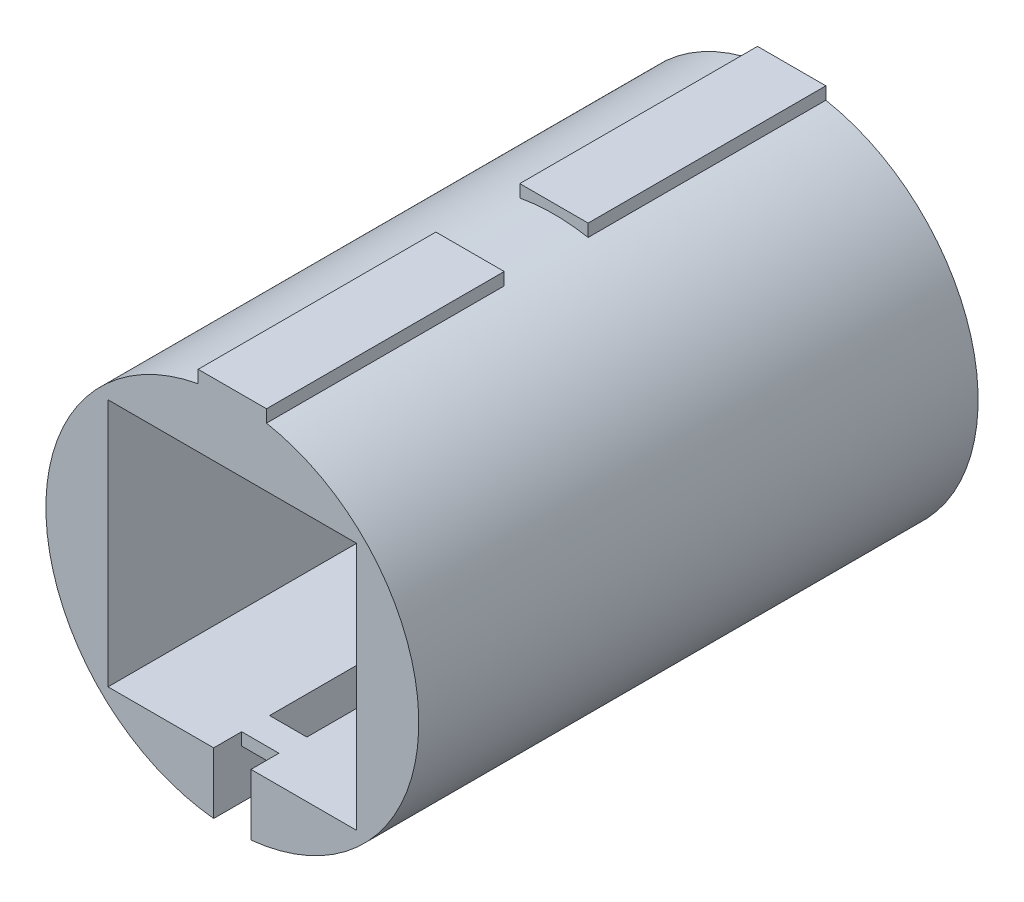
ISO-10303-21;
HEADER;
FILE_DESCRIPTION(('STEP AP214'),'2;1');
FILE_NAME('part.step','',(''),(''),'','','');
FILE_SCHEMA(('AUTOMOTIVE_DESIGN { 1 0 10303 214 1 1 1 1 }'));
ENDSEC;
DATA;
#1=APPLICATION_CONTEXT('core data for automotive mechanical design processes');
#2=APPLICATION_PROTOCOL_DEFINITION('international standard','automotive_design',2000,#1);
#3=PRODUCT_CONTEXT('',#1,'mechanical');
#4=PRODUCT('Part','Part','',(#3));
#5=PRODUCT_RELATED_PRODUCT_CATEGORY('part','',(#4));
#6=PRODUCT_DEFINITION_FORMATION('','',#4);
#7=PRODUCT_DEFINITION_CONTEXT('part definition',#1,'design');
#8=PRODUCT_DEFINITION('design','',#6,#7);
#9=PRODUCT_DEFINITION_SHAPE('','',#8);
#10=(LENGTH_UNIT() NAMED_UNIT(*) SI_UNIT(.MILLI.,.METRE.));
#11=(NAMED_UNIT(*) PLANE_ANGLE_UNIT() SI_UNIT($,.RADIAN.));
#12=(NAMED_UNIT(*) SI_UNIT($,.STERADIAN.) SOLID_ANGLE_UNIT());
#13=UNCERTAINTY_MEASURE_WITH_UNIT(LENGTH_MEASURE(1.E-05),#10,'distance_accuracy_value','');
#14=(GEOMETRIC_REPRESENTATION_CONTEXT(3) GLOBAL_UNCERTAINTY_ASSIGNED_CONTEXT((#13)) GLOBAL_UNIT_ASSIGNED_CONTEXT((#10,
#11,#12)) REPRESENTATION_CONTEXT('',''));
#15=CARTESIAN_POINT('',(0.,0.,0.));
#16=DIRECTION('',(0.,0.,1.));
#17=DIRECTION('',(1.,0.,0.));
#18=AXIS2_PLACEMENT_3D('',#15,#16,#17);
#19=CARTESIAN_POINT('',(0.,0.,22.5));
#20=DIRECTION('',(0.,0.,-1.));
#21=DIRECTION('',(-1.,0.,0.));
#22=AXIS2_PLACEMENT_3D('',#19,#20,#21);
#23=CYLINDRICAL_SURFACE('',#22,15.);
#24=DIRECTION('',(0.,0.,-1.));
#25=VECTOR('',#24,1.);
#26=CARTESIAN_POINT('',(2.75,14.7457621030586,22.5));
#27=LINE('',#26,#25);
#28=CARTESIAN_POINT('',(2.75,14.7457621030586,-22.5));
#29=VERTEX_POINT('',#28);
#30=CARTESIAN_POINT('',(2.75,14.7457621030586,-3.375));
#31=VERTEX_POINT('',#30);
#32=EDGE_CURVE('E204',#29,#31,#27,.F.);
#33=ORIENTED_EDGE('',*,*,#32,.T.);
#34=CARTESIAN_POINT('',(0.,-6.15826833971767E-13,-3.375));
#35=DIRECTION('',(0.,0.,1.));
#36=DIRECTION('',(1.,0.,0.));
#37=AXIS2_PLACEMENT_3D('',#34,#35,#36);
#38=CIRCLE('',#37,15.0000000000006);
#39=CARTESIAN_POINT('',(-2.75,14.7457621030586,-3.375));
#40=VERTEX_POINT('',#39);
#41=EDGE_CURVE('E29',#31,#40,#38,.T.);
#42=ORIENTED_EDGE('',*,*,#41,.T.);
#43=DIRECTION('',(0.,0.,-1.));
#44=VECTOR('',#43,1.);
#45=CARTESIAN_POINT('',(-2.75,14.7457621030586,22.5));
#46=LINE('',#45,#44);
#47=CARTESIAN_POINT('',(-2.75,14.7457621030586,-22.5));
#48=VERTEX_POINT('',#47);
#49=EDGE_CURVE('E200',#48,#40,#46,.F.);
#50=ORIENTED_EDGE('',*,*,#49,.F.);
#51=CARTESIAN_POINT('',(0.,0.,-22.5));
#52=DIRECTION('',(0.,0.,1.));
#53=DIRECTION('',(1.,0.,0.));
#54=AXIS2_PLACEMENT_3D('',#51,#52,#53);
#55=CIRCLE('',#54,15.);
#56=CARTESIAN_POINT('',(-1.5,-14.9248115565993,-22.5));
#57=VERTEX_POINT('',#56);
#58=EDGE_CURVE('E287',#48,#57,#55,.T.);
#59=ORIENTED_EDGE('',*,*,#58,.T.);
#60=DIRECTION('',(0.,0.,-1.));
#61=VECTOR('',#60,1.);
#62=CARTESIAN_POINT('',(-1.5,-14.9248115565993,22.5));
#63=LINE('',#62,#61);
#64=CARTESIAN_POINT('',(-1.5,-14.9248115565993,22.5));
#65=VERTEX_POINT('',#64);
#66=EDGE_CURVE('E9',#65,#57,#63,.T.);
#67=ORIENTED_EDGE('',*,*,#66,.F.);
#68=CARTESIAN_POINT('',(0.,0.,22.5));
#69=DIRECTION('',(0.,0.,1.));
#70=DIRECTION('',(1.,0.,0.));
#71=AXIS2_PLACEMENT_3D('',#68,#69,#70);
#72=CIRCLE('',#71,15.);
#73=CARTESIAN_POINT('',(-2.75,14.7457621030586,22.5));
#74=VERTEX_POINT('',#73);
#75=EDGE_CURVE('E288',#74,#65,#72,.T.);
#76=ORIENTED_EDGE('',*,*,#75,.F.);
#77=DIRECTION('',(0.,0.,-1.));
#78=VECTOR('',#77,1.);
#79=CARTESIAN_POINT('',(-2.75,14.7457621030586,22.5));
#80=LINE('',#79,#78);
#81=CARTESIAN_POINT('',(-2.75,14.7457621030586,3.375));
#82=VERTEX_POINT('',#81);
#83=EDGE_CURVE('E217',#82,#74,#80,.F.);
#84=ORIENTED_EDGE('',*,*,#83,.F.);
#85=CARTESIAN_POINT('',(0.,-6.15826833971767E-13,3.375));
#86=DIRECTION('',(0.,0.,1.));
#87=DIRECTION('',(1.,0.,0.));
#88=AXIS2_PLACEMENT_3D('',#85,#86,#87);
#89=CIRCLE('',#88,15.0000000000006);
#90=CARTESIAN_POINT('',(2.75,14.7457621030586,3.375));
#91=VERTEX_POINT('',#90);
#92=EDGE_CURVE('E230',#91,#82,#89,.T.);
#93=ORIENTED_EDGE('',*,*,#92,.F.);
#94=DIRECTION('',(0.,0.,-1.));
#95=VECTOR('',#94,1.);
#96=CARTESIAN_POINT('',(2.75,14.7457621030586,22.5));
#97=LINE('',#96,#95);
#98=CARTESIAN_POINT('',(2.75,14.7457621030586,22.5));
#99=VERTEX_POINT('',#98);
#100=EDGE_CURVE('E181',#91,#99,#97,.F.);
#101=ORIENTED_EDGE('',*,*,#100,.T.);
#102=CARTESIAN_POINT('',(0.,0.,22.5));
#103=DIRECTION('',(0.,0.,1.));
#104=DIRECTION('',(1.,0.,0.));
#105=AXIS2_PLACEMENT_3D('',#102,#103,#104);
#106=CIRCLE('',#105,15.);
#107=CARTESIAN_POINT('',(1.5,-14.9248115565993,22.5));
#108=VERTEX_POINT('',#107);
#109=EDGE_CURVE('E305',#108,#99,#106,.T.);
#110=ORIENTED_EDGE('',*,*,#109,.F.);
#111=DIRECTION('',(0.,0.,-1.));
#112=VECTOR('',#111,1.);
#113=CARTESIAN_POINT('',(1.5,-14.9248115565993,22.5));
#114=LINE('',#113,#112);
#115=CARTESIAN_POINT('',(1.5,-14.9248115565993,-22.5));
#116=VERTEX_POINT('',#115);
#117=EDGE_CURVE('E310',#108,#116,#114,.T.);
#118=ORIENTED_EDGE('',*,*,#117,.T.);
#119=CARTESIAN_POINT('',(0.,0.,-22.5));
#120=DIRECTION('',(0.,0.,1.));
#121=DIRECTION('',(1.,0.,0.));
#122=AXIS2_PLACEMENT_3D('',#119,#120,#121);
#123=CIRCLE('',#122,15.);
#124=EDGE_CURVE('E328',#116,#29,#123,.T.);
#125=ORIENTED_EDGE('',*,*,#124,.T.);
#126=EDGE_LOOP('',(#33,#42,#50,#59,#67,#76,#84,#93,#101,#110,#118,#125));
#127=FACE_BOUND('',#126,.T.);
#128=ADVANCED_FACE('F14',(#127),#23,.T.);
#129=CARTESIAN_POINT('',(1.5,15.75,22.5));
#130=DIRECTION('',(0.,-1.,0.));
#131=DIRECTION('',(0.,0.,-1.));
#132=AXIS2_PLACEMENT_3D('',#129,#130,#131);
#133=PLANE('',#132);
#134=DIRECTION('',(-1.,0.,0.));
#135=VECTOR('',#134,1.);
#136=CARTESIAN_POINT('',(1.5,15.75,-3.375));
#137=LINE('',#136,#135);
#138=CARTESIAN_POINT('',(2.75,15.75,-3.375));
#139=VERTEX_POINT('',#138);
#140=CARTESIAN_POINT('',(-2.75,15.75,-3.375));
#141=VERTEX_POINT('',#140);
#142=EDGE_CURVE('E174',#139,#141,#137,.T.);
#143=ORIENTED_EDGE('',*,*,#142,.F.);
#144=DIRECTION('',(0.,0.,1.));
#145=VECTOR('',#144,1.);
#146=CARTESIAN_POINT('',(2.75,15.75,-3.375));
#147=LINE('',#146,#145);
#148=CARTESIAN_POINT('',(2.75,15.75,-22.5));
#149=VERTEX_POINT('',#148);
#150=EDGE_CURVE('E177',#149,#139,#147,.T.);
#151=ORIENTED_EDGE('',*,*,#150,.F.);
#152=DIRECTION('',(-1.,0.,0.));
#153=VECTOR('',#152,1.);
#154=CARTESIAN_POINT('',(1.5,15.75,-22.5));
#155=LINE('',#154,#153);
#156=CARTESIAN_POINT('',(-2.75,15.75,-22.5));
#157=VERTEX_POINT('',#156);
#158=EDGE_CURVE('E291',#149,#157,#155,.T.);
#159=ORIENTED_EDGE('',*,*,#158,.T.);
#160=DIRECTION('',(0.,0.,1.));
#161=VECTOR('',#160,1.);
#162=CARTESIAN_POINT('',(-2.75,15.75,-3.375));
#163=LINE('',#162,#161);
#164=EDGE_CURVE('E179',#157,#141,#163,.T.);
#165=ORIENTED_EDGE('',*,*,#164,.T.);
#166=EDGE_LOOP('',(#143,#151,#159,#165));
#167=FACE_BOUND('',#166,.T.);
#168=ADVANCED_FACE('F175',(#167),#133,.F.);
#169=CARTESIAN_POINT('',(-1.5,-14.9248115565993,22.5));
#170=DIRECTION('',(-1.,0.,0.));
#171=DIRECTION('',(0.,0.,1.));
#172=AXIS2_PLACEMENT_3D('',#169,#170,#171);
#173=PLANE('',#172);
#174=DIRECTION('',(0.,0.,-1.));
#175=VECTOR('',#174,1.);
#176=CARTESIAN_POINT('',(-1.5,-11.,-15.75));
#177=LINE('',#176,#175);
#178=CARTESIAN_POINT('',(-1.5,-11.,-15.75));
#179=VERTEX_POINT('',#178);
#180=CARTESIAN_POINT('',(-1.5,-11.,-18.));
#181=VERTEX_POINT('',#180);
#182=EDGE_CURVE('E257',#179,#181,#177,.T.);
#183=ORIENTED_EDGE('',*,*,#182,.F.);
#184=DIRECTION('',(0.,-1.,0.));
#185=VECTOR('',#184,1.);
#186=CARTESIAN_POINT('',(-1.5,-10.,-15.75));
#187=LINE('',#186,#185);
#188=CARTESIAN_POINT('',(-1.5,-10.,-15.75));
#189=VERTEX_POINT('',#188);
#190=EDGE_CURVE('E234',#189,#179,#187,.T.);
#191=ORIENTED_EDGE('',*,*,#190,.F.);
#192=DIRECTION('',(0.,0.,-1.));
#193=VECTOR('',#192,1.);
#194=CARTESIAN_POINT('',(-1.5,-10.,22.5));
#195=LINE('',#194,#193);
#196=CARTESIAN_POINT('',(-1.5,-10.,18.));
#197=VERTEX_POINT('',#196);
#198=EDGE_CURVE('E350',#197,#189,#195,.T.);
#199=ORIENTED_EDGE('',*,*,#198,.F.);
#200=DIRECTION('',(0.,-1.,0.));
#201=VECTOR('',#200,1.);
#202=CARTESIAN_POINT('',(-1.5,-10.,18.));
#203=LINE('',#202,#201);
#204=CARTESIAN_POINT('',(-1.5,-11.,18.));
#205=VERTEX_POINT('',#204);
#206=EDGE_CURVE('E260',#197,#205,#203,.T.);
#207=ORIENTED_EDGE('',*,*,#206,.T.);
#208=DIRECTION('',(0.,0.,-1.));
#209=VECTOR('',#208,1.);
#210=CARTESIAN_POINT('',(-1.5,-11.,20.25));
#211=LINE('',#210,#209);
#212=CARTESIAN_POINT('',(-1.5,-11.,20.25));
#213=VERTEX_POINT('',#212);
#214=EDGE_CURVE('E284',#213,#205,#211,.T.);
#215=ORIENTED_EDGE('',*,*,#214,.F.);
#216=DIRECTION('',(0.,-1.,0.));
#217=VECTOR('',#216,1.);
#218=CARTESIAN_POINT('',(-1.5,-10.,20.25));
#219=LINE('',#218,#217);
#220=CARTESIAN_POINT('',(-1.5,-10.,20.25));
#221=VERTEX_POINT('',#220);
#222=EDGE_CURVE('E261',#221,#213,#219,.T.);
#223=ORIENTED_EDGE('',*,*,#222,.F.);
#224=CARTESIAN_POINT('',(-1.5,-10.,22.5));
#225=VERTEX_POINT('',#224);
#226=EDGE_CURVE('E22',#225,#221,#195,.T.);
#227=ORIENTED_EDGE('',*,*,#226,.F.);
#228=DIRECTION('',(0.,1.,0.));
#229=VECTOR('',#228,1.);
#230=CARTESIAN_POINT('',(-1.5,-14.9248115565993,22.5));
#231=LINE('',#230,#229);
#232=EDGE_CURVE('E290',#65,#225,#231,.T.);
#233=ORIENTED_EDGE('',*,*,#232,.F.);
#234=ORIENTED_EDGE('',*,*,#66,.T.);
#235=DIRECTION('',(0.,1.,0.));
#236=VECTOR('',#235,1.);
#237=CARTESIAN_POINT('',(-1.5,-14.9248115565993,-22.5));
#238=LINE('',#237,#236);
#239=CARTESIAN_POINT('',(-1.5,-10.,-22.5));
#240=VERTEX_POINT('',#239);
#241=EDGE_CURVE('E312',#57,#240,#238,.T.);
#242=ORIENTED_EDGE('',*,*,#241,.T.);
#243=CARTESIAN_POINT('',(-1.5,-10.,-18.));
#244=VERTEX_POINT('',#243);
#245=EDGE_CURVE('E348',#244,#240,#195,.T.);
#246=ORIENTED_EDGE('',*,*,#245,.F.);
#247=DIRECTION('',(0.,-1.,0.));
#248=VECTOR('',#247,1.);
#249=CARTESIAN_POINT('',(-1.5,-10.,-18.));
#250=LINE('',#249,#248);
#251=EDGE_CURVE('E231',#244,#181,#250,.T.);
#252=ORIENTED_EDGE('',*,*,#251,.T.);
#253=EDGE_LOOP('',(#183,#191,#199,#207,#215,#223,#227,#233,#234,#242,#246,#252));
#254=FACE_BOUND('',#253,.T.);
#255=ADVANCED_FACE('F16',(#254),#173,.F.);
#256=CARTESIAN_POINT('',(-10.,-10.,22.5));
#257=DIRECTION('',(-1.,0.,0.));
#258=DIRECTION('',(0.,0.,1.));
#259=AXIS2_PLACEMENT_3D('',#256,#257,#258);
#260=PLANE('',#259);
#261=DIRECTION('',(0.,1.,0.));
#262=VECTOR('',#261,1.);
#263=CARTESIAN_POINT('',(-10.,-10.,-22.5));
#264=LINE('',#263,#262);
#265=CARTESIAN_POINT('',(-10.,-10.,-22.5));
#266=VERTEX_POINT('',#265);
#267=CARTESIAN_POINT('',(-10.,10.,-22.5));
#268=VERTEX_POINT('',#267);
#269=EDGE_CURVE('E317',#266,#268,#264,.T.);
#270=ORIENTED_EDGE('',*,*,#269,.T.);
#271=DIRECTION('',(0.,0.,-1.));
#272=VECTOR('',#271,1.);
#273=CARTESIAN_POINT('',(-10.,10.,22.5));
#274=LINE('',#273,#272);
#275=CARTESIAN_POINT('',(-10.,10.,22.5));
#276=VERTEX_POINT('',#275);
#277=EDGE_CURVE('E343',#276,#268,#274,.T.);
#278=ORIENTED_EDGE('',*,*,#277,.F.);
#279=DIRECTION('',(0.,1.,0.));
#280=VECTOR('',#279,1.);
#281=CARTESIAN_POINT('',(-10.,-10.,22.5));
#282=LINE('',#281,#280);
#283=CARTESIAN_POINT('',(-10.,-10.,22.5));
#284=VERTEX_POINT('',#283);
#285=EDGE_CURVE('E295',#284,#276,#282,.T.);
#286=ORIENTED_EDGE('',*,*,#285,.F.);
#287=DIRECTION('',(0.,0.,-1.));
#288=VECTOR('',#287,1.);
#289=CARTESIAN_POINT('',(-10.,-10.,22.5));
#290=LINE('',#289,#288);
#291=EDGE_CURVE('E346',#284,#266,#290,.T.);
#292=ORIENTED_EDGE('',*,*,#291,.T.);
#293=EDGE_LOOP('',(#270,#278,#286,#292));
#294=FACE_BOUND('',#293,.T.);
#295=ADVANCED_FACE('F376',(#294),#260,.F.);
#296=CARTESIAN_POINT('',(-10.,10.,22.5));
#297=DIRECTION('',(0.,1.,0.));
#298=DIRECTION('',(0.,0.,1.));
#299=AXIS2_PLACEMENT_3D('',#296,#297,#298);
#300=PLANE('',#299);
#301=DIRECTION('',(1.,0.,0.));
#302=VECTOR('',#301,1.);
#303=CARTESIAN_POINT('',(-10.,10.,-22.5));
#304=LINE('',#303,#302);
#305=CARTESIAN_POINT('',(10.,10.,-22.5));
#306=VERTEX_POINT('',#305);
#307=EDGE_CURVE('E319',#268,#306,#304,.T.);
#308=ORIENTED_EDGE('',*,*,#307,.T.);
#309=DIRECTION('',(0.,0.,-1.));
#310=VECTOR('',#309,1.);
#311=CARTESIAN_POINT('',(10.,10.,22.5));
#312=LINE('',#311,#310);
#313=CARTESIAN_POINT('',(10.,10.,22.5));
#314=VERTEX_POINT('',#313);
#315=EDGE_CURVE('E340',#314,#306,#312,.T.);
#316=ORIENTED_EDGE('',*,*,#315,.F.);
#317=DIRECTION('',(1.,0.,0.));
#318=VECTOR('',#317,1.);
#319=CARTESIAN_POINT('',(-10.,10.,22.5));
#320=LINE('',#319,#318);
#321=EDGE_CURVE('E297',#276,#314,#320,.T.);
#322=ORIENTED_EDGE('',*,*,#321,.F.);
#323=ORIENTED_EDGE('',*,*,#277,.T.);
#324=EDGE_LOOP('',(#308,#316,#322,#323));
#325=FACE_BOUND('',#324,.T.);
#326=ADVANCED_FACE('F380',(#325),#300,.F.);
#327=CARTESIAN_POINT('',(10.,10.,22.5));
#328=DIRECTION('',(1.,0.,0.));
#329=DIRECTION('',(0.,0.,-1.));
#330=AXIS2_PLACEMENT_3D('',#327,#328,#329);
#331=PLANE('',#330);
#332=DIRECTION('',(0.,-1.,0.));
#333=VECTOR('',#332,1.);
#334=CARTESIAN_POINT('',(10.,10.,-22.5));
#335=LINE('',#334,#333);
#336=CARTESIAN_POINT('',(10.,-10.,-22.5));
#337=VERTEX_POINT('',#336);
#338=EDGE_CURVE('E321',#306,#337,#335,.T.);
#339=ORIENTED_EDGE('',*,*,#338,.T.);
#340=DIRECTION('',(0.,0.,-1.));
#341=VECTOR('',#340,1.);
#342=CARTESIAN_POINT('',(10.,-10.,22.5));
#343=LINE('',#342,#341);
#344=CARTESIAN_POINT('',(10.,-10.,22.5));
#345=VERTEX_POINT('',#344);
#346=EDGE_CURVE('E336',#345,#337,#343,.T.);
#347=ORIENTED_EDGE('',*,*,#346,.F.);
#348=DIRECTION('',(0.,-1.,0.));
#349=VECTOR('',#348,1.);
#350=CARTESIAN_POINT('',(10.,10.,22.5));
#351=LINE('',#350,#349);
#352=EDGE_CURVE('E299',#314,#345,#351,.T.);
#353=ORIENTED_EDGE('',*,*,#352,.F.);
#354=ORIENTED_EDGE('',*,*,#315,.T.);
#355=EDGE_LOOP('',(#339,#347,#353,#354));
#356=FACE_BOUND('',#355,.T.);
#357=ADVANCED_FACE('F437',(#356),#331,.F.);
#358=CARTESIAN_POINT('',(10.,-10.,22.5));
#359=DIRECTION('',(0.,-1.,0.));
#360=DIRECTION('',(0.,0.,-1.));
#361=AXIS2_PLACEMENT_3D('',#358,#359,#360);
#362=PLANE('',#361);
#363=DIRECTION('',(-1.,0.,0.));
#364=VECTOR('',#363,1.);
#365=CARTESIAN_POINT('',(1.5,-10.,-18.));
#366=LINE('',#365,#364);
#367=CARTESIAN_POINT('',(1.5,-10.,-18.));
#368=VERTEX_POINT('',#367);
#369=EDGE_CURVE('E238',#368,#244,#366,.T.);
#370=ORIENTED_EDGE('',*,*,#369,.T.);
#371=ORIENTED_EDGE('',*,*,#245,.T.);
#372=DIRECTION('',(-1.,0.,0.));
#373=VECTOR('',#372,1.);
#374=CARTESIAN_POINT('',(-1.5,-10.,-22.5));
#375=LINE('',#374,#373);
#376=EDGE_CURVE('E315',#240,#266,#375,.T.);
#377=ORIENTED_EDGE('',*,*,#376,.T.);
#378=ORIENTED_EDGE('',*,*,#291,.F.);
#379=DIRECTION('',(-1.,0.,0.));
#380=VECTOR('',#379,1.);
#381=CARTESIAN_POINT('',(-1.5,-10.,22.5));
#382=LINE('',#381,#380);
#383=EDGE_CURVE('E293',#225,#284,#382,.T.);
#384=ORIENTED_EDGE('',*,*,#383,.F.);
#385=ORIENTED_EDGE('',*,*,#226,.T.);
#386=DIRECTION('',(-1.,0.,0.));
#387=VECTOR('',#386,1.);
#388=CARTESIAN_POINT('',(1.5,-10.,20.25));
#389=LINE('',#388,#387);
#390=CARTESIAN_POINT('',(1.5,-10.,20.25));
#391=VERTEX_POINT('',#390);
#392=EDGE_CURVE('E271',#391,#221,#389,.T.);
#393=ORIENTED_EDGE('',*,*,#392,.F.);
#394=DIRECTION('',(0.,0.,-1.));
#395=VECTOR('',#394,1.);
#396=CARTESIAN_POINT('',(1.5,-10.,22.5));
#397=LINE('',#396,#395);
#398=CARTESIAN_POINT('',(1.5,-10.,22.5));
#399=VERTEX_POINT('',#398);
#400=EDGE_CURVE('E334',#399,#391,#397,.T.);
#401=ORIENTED_EDGE('',*,*,#400,.F.);
#402=DIRECTION('',(-1.,0.,0.));
#403=VECTOR('',#402,1.);
#404=CARTESIAN_POINT('',(10.,-10.,22.5));
#405=LINE('',#404,#403);
#406=EDGE_CURVE('E301',#345,#399,#405,.T.);
#407=ORIENTED_EDGE('',*,*,#406,.F.);
#408=ORIENTED_EDGE('',*,*,#346,.T.);
#409=DIRECTION('',(-1.,0.,0.));
#410=VECTOR('',#409,1.);
#411=CARTESIAN_POINT('',(10.,-10.,-22.5));
#412=LINE('',#411,#410);
#413=CARTESIAN_POINT('',(1.5,-10.,-22.5));
#414=VERTEX_POINT('',#413);
#415=EDGE_CURVE('E323',#337,#414,#412,.T.);
#416=ORIENTED_EDGE('',*,*,#415,.T.);
#417=EDGE_CURVE('E333',#368,#414,#397,.T.);
#418=ORIENTED_EDGE('',*,*,#417,.F.);
#419=EDGE_LOOP('',(#370,#371,#377,#378,#384,#385,#393,#401,#407,#408,#416,#418));
#420=FACE_BOUND('',#419,.T.);
#421=ORIENTED_EDGE('',*,*,#198,.T.);
#422=DIRECTION('',(-1.,0.,0.));
#423=VECTOR('',#422,1.);
#424=CARTESIAN_POINT('',(1.5,-10.,-15.75));
#425=LINE('',#424,#423);
#426=CARTESIAN_POINT('',(1.5,-10.,-15.75));
#427=VERTEX_POINT('',#426);
#428=EDGE_CURVE('E244',#427,#189,#425,.T.);
#429=ORIENTED_EDGE('',*,*,#428,.F.);
#430=CARTESIAN_POINT('',(1.5,-10.,18.));
#431=VERTEX_POINT('',#430);
#432=EDGE_CURVE('E337',#431,#427,#397,.T.);
#433=ORIENTED_EDGE('',*,*,#432,.F.);
#434=DIRECTION('',(-1.,0.,0.));
#435=VECTOR('',#434,1.);
#436=CARTESIAN_POINT('',(1.5,-10.,18.));
#437=LINE('',#436,#435);
#438=EDGE_CURVE('E265',#431,#197,#437,.T.);
#439=ORIENTED_EDGE('',*,*,#438,.T.);
#440=EDGE_LOOP('',(#421,#429,#433,#439));
#441=FACE_BOUND('',#440,.T.);
#442=ADVANCED_FACE('F357',(#420,#441),#362,.F.);
#443=CARTESIAN_POINT('',(1.5,-10.,22.5));
#444=DIRECTION('',(1.,0.,0.));
#445=DIRECTION('',(0.,0.,-1.));
#446=AXIS2_PLACEMENT_3D('',#443,#444,#445);
#447=PLANE('',#446);
#448=ORIENTED_EDGE('',*,*,#432,.T.);
#449=DIRECTION('',(0.,1.,0.));
#450=VECTOR('',#449,1.);
#451=CARTESIAN_POINT('',(1.5,-11.,-15.75));
#452=LINE('',#451,#450);
#453=CARTESIAN_POINT('',(1.5,-11.,-15.75));
#454=VERTEX_POINT('',#453);
#455=EDGE_CURVE('E241',#454,#427,#452,.T.);
#456=ORIENTED_EDGE('',*,*,#455,.F.);
#457=DIRECTION('',(0.,0.,-1.));
#458=VECTOR('',#457,1.);
#459=CARTESIAN_POINT('',(1.5,-11.,-15.75));
#460=LINE('',#459,#458);
#461=CARTESIAN_POINT('',(1.5,-11.,-18.));
#462=VERTEX_POINT('',#461);
#463=EDGE_CURVE('E246',#454,#462,#460,.T.);
#464=ORIENTED_EDGE('',*,*,#463,.T.);
#465=DIRECTION('',(0.,1.,0.));
#466=VECTOR('',#465,1.);
#467=CARTESIAN_POINT('',(1.5,-11.,-18.));
#468=LINE('',#467,#466);
#469=EDGE_CURVE('E252',#462,#368,#468,.T.);
#470=ORIENTED_EDGE('',*,*,#469,.T.);
#471=ORIENTED_EDGE('',*,*,#417,.T.);
#472=DIRECTION('',(0.,-1.,0.));
#473=VECTOR('',#472,1.);
#474=CARTESIAN_POINT('',(1.5,-10.,-22.5));
#475=LINE('',#474,#473);
#476=EDGE_CURVE('E326',#414,#116,#475,.T.);
#477=ORIENTED_EDGE('',*,*,#476,.T.);
#478=ORIENTED_EDGE('',*,*,#117,.F.);
#479=DIRECTION('',(0.,-1.,0.));
#480=VECTOR('',#479,1.);
#481=CARTESIAN_POINT('',(1.5,-10.,22.5));
#482=LINE('',#481,#480);
#483=EDGE_CURVE('E303',#399,#108,#482,.T.);
#484=ORIENTED_EDGE('',*,*,#483,.F.);
#485=ORIENTED_EDGE('',*,*,#400,.T.);
#486=DIRECTION('',(0.,1.,0.));
#487=VECTOR('',#486,1.);
#488=CARTESIAN_POINT('',(1.5,-11.,20.25));
#489=LINE('',#488,#487);
#490=CARTESIAN_POINT('',(1.5,-11.,20.25));
#491=VERTEX_POINT('',#490);
#492=EDGE_CURVE('E268',#491,#391,#489,.T.);
#493=ORIENTED_EDGE('',*,*,#492,.F.);
#494=DIRECTION('',(0.,0.,-1.));
#495=VECTOR('',#494,1.);
#496=CARTESIAN_POINT('',(1.5,-11.,20.25));
#497=LINE('',#496,#495);
#498=CARTESIAN_POINT('',(1.5,-11.,18.));
#499=VERTEX_POINT('',#498);
#500=EDGE_CURVE('E273',#491,#499,#497,.T.);
#501=ORIENTED_EDGE('',*,*,#500,.T.);
#502=DIRECTION('',(0.,1.,0.));
#503=VECTOR('',#502,1.);
#504=CARTESIAN_POINT('',(1.5,-11.,18.));
#505=LINE('',#504,#503);
#506=EDGE_CURVE('E279',#499,#431,#505,.T.);
#507=ORIENTED_EDGE('',*,*,#506,.T.);
#508=EDGE_LOOP('',(#448,#456,#464,#470,#471,#477,#478,#484,#485,#493,#501,#507));
#509=FACE_BOUND('',#508,.T.);
#510=ADVANCED_FACE('F396',(#509),#447,.F.);
#511=DIRECTION('',(-1.,0.,0.));
#512=VECTOR('',#511,1.);
#513=CARTESIAN_POINT('',(1.5,15.75,22.5));
#514=LINE('',#513,#512);
#515=CARTESIAN_POINT('',(2.75,15.75,22.5));
#516=VERTEX_POINT('',#515);
#517=CARTESIAN_POINT('',(-2.75,15.75,22.5));
#518=VERTEX_POINT('',#517);
#519=EDGE_CURVE('E308',#516,#518,#514,.T.);
#520=ORIENTED_EDGE('',*,*,#519,.F.);
#521=DIRECTION('',(0.,0.,1.));
#522=VECTOR('',#521,1.);
#523=CARTESIAN_POINT('',(2.75,15.75,22.5));
#524=LINE('',#523,#522);
#525=CARTESIAN_POINT('',(2.75,15.75,3.375));
#526=VERTEX_POINT('',#525);
#527=EDGE_CURVE('E207',#526,#516,#524,.T.);
#528=ORIENTED_EDGE('',*,*,#527,.F.);
#529=DIRECTION('',(-1.,0.,0.));
#530=VECTOR('',#529,1.);
#531=CARTESIAN_POINT('',(1.5,15.75,3.375));
#532=LINE('',#531,#530);
#533=CARTESIAN_POINT('',(-2.75,15.75,3.375));
#534=VERTEX_POINT('',#533);
#535=EDGE_CURVE('E228',#526,#534,#532,.T.);
#536=ORIENTED_EDGE('',*,*,#535,.T.);
#537=DIRECTION('',(0.,0.,1.));
#538=VECTOR('',#537,1.);
#539=CARTESIAN_POINT('',(-2.75,15.75,22.5));
#540=LINE('',#539,#538);
#541=EDGE_CURVE('E206',#534,#518,#540,.T.);
#542=ORIENTED_EDGE('',*,*,#541,.T.);
#543=EDGE_LOOP('',(#520,#528,#536,#542));
#544=FACE_BOUND('',#543,.T.);
#545=ADVANCED_FACE('F405',(#544),#133,.F.);
#546=CARTESIAN_POINT('',(0.,0.,22.5));
#547=DIRECTION('',(0.,0.,1.));
#548=DIRECTION('',(1.,0.,0.));
#549=AXIS2_PLACEMENT_3D('',#546,#547,#548);
#550=PLANE('',#549);
#551=ORIENTED_EDGE('',*,*,#109,.T.);
#552=DIRECTION('',(0.,-1.,0.));
#553=VECTOR('',#552,1.);
#554=CARTESIAN_POINT('',(2.75,14.25,22.5));
#555=LINE('',#554,#553);
#556=EDGE_CURVE('E210',#516,#99,#555,.T.);
#557=ORIENTED_EDGE('',*,*,#556,.F.);
#558=ORIENTED_EDGE('',*,*,#519,.T.);
#559=DIRECTION('',(0.,-1.,0.));
#560=VECTOR('',#559,1.);
#561=CARTESIAN_POINT('',(-2.75,14.25,22.5));
#562=LINE('',#561,#560);
#563=EDGE_CURVE('E220',#518,#74,#562,.T.);
#564=ORIENTED_EDGE('',*,*,#563,.T.);
#565=ORIENTED_EDGE('',*,*,#75,.T.);
#566=ORIENTED_EDGE('',*,*,#232,.T.);
#567=ORIENTED_EDGE('',*,*,#383,.T.);
#568=ORIENTED_EDGE('',*,*,#285,.T.);
#569=ORIENTED_EDGE('',*,*,#321,.T.);
#570=ORIENTED_EDGE('',*,*,#352,.T.);
#571=ORIENTED_EDGE('',*,*,#406,.T.);
#572=ORIENTED_EDGE('',*,*,#483,.T.);
#573=EDGE_LOOP('',(#551,#557,#558,#564,#565,#566,#567,#568,#569,#570,#571,#572));
#574=FACE_BOUND('',#573,.T.);
#575=ADVANCED_FACE('F384',(#574),#550,.T.);
#576=CARTESIAN_POINT('',(0.,0.,-22.5));
#577=DIRECTION('',(0.,0.,1.));
#578=DIRECTION('',(1.,0.,0.));
#579=AXIS2_PLACEMENT_3D('',#576,#577,#578);
#580=PLANE('',#579);
#581=ORIENTED_EDGE('',*,*,#58,.F.);
#582=DIRECTION('',(0.,1.,0.));
#583=VECTOR('',#582,1.);
#584=CARTESIAN_POINT('',(-2.75,14.25,-22.5));
#585=LINE('',#584,#583);
#586=EDGE_CURVE('E193',#48,#157,#585,.T.);
#587=ORIENTED_EDGE('',*,*,#586,.T.);
#588=ORIENTED_EDGE('',*,*,#158,.F.);
#589=DIRECTION('',(0.,1.,0.));
#590=VECTOR('',#589,1.);
#591=CARTESIAN_POINT('',(2.75,14.25,-22.5));
#592=LINE('',#591,#590);
#593=EDGE_CURVE('E188',#29,#149,#592,.T.);
#594=ORIENTED_EDGE('',*,*,#593,.F.);
#595=ORIENTED_EDGE('',*,*,#124,.F.);
#596=ORIENTED_EDGE('',*,*,#476,.F.);
#597=ORIENTED_EDGE('',*,*,#415,.F.);
#598=ORIENTED_EDGE('',*,*,#338,.F.);
#599=ORIENTED_EDGE('',*,*,#307,.F.);
#600=ORIENTED_EDGE('',*,*,#269,.F.);
#601=ORIENTED_EDGE('',*,*,#376,.F.);
#602=ORIENTED_EDGE('',*,*,#241,.F.);
#603=EDGE_LOOP('',(#581,#587,#588,#594,#595,#596,#597,#598,#599,#600,#601,#602));
#604=FACE_BOUND('',#603,.T.);
#605=ADVANCED_FACE('F371',(#604),#580,.F.);
#606=CARTESIAN_POINT('',(-1.5,-11.,20.25));
#607=DIRECTION('',(0.,1.,0.));
#608=DIRECTION('',(0.,0.,1.));
#609=AXIS2_PLACEMENT_3D('',#606,#607,#608);
#610=PLANE('',#609);
#611=DIRECTION('',(1.,0.,0.));
#612=VECTOR('',#611,1.);
#613=CARTESIAN_POINT('',(-1.5,-11.,18.));
#614=LINE('',#613,#612);
#615=EDGE_CURVE('E276',#205,#499,#614,.T.);
#616=ORIENTED_EDGE('',*,*,#615,.T.);
#617=ORIENTED_EDGE('',*,*,#500,.F.);
#618=DIRECTION('',(1.,0.,0.));
#619=VECTOR('',#618,1.);
#620=CARTESIAN_POINT('',(-1.5,-11.,20.25));
#621=LINE('',#620,#619);
#622=EDGE_CURVE('E264',#213,#491,#621,.T.);
#623=ORIENTED_EDGE('',*,*,#622,.F.);
#624=ORIENTED_EDGE('',*,*,#214,.T.);
#625=EDGE_LOOP('',(#616,#617,#623,#624));
#626=FACE_BOUND('',#625,.T.);
#627=ADVANCED_FACE('F515',(#626),#610,.F.);
#628=CARTESIAN_POINT('',(0.,0.,20.25));
#629=DIRECTION('',(0.,0.,1.));
#630=DIRECTION('',(1.,0.,0.));
#631=AXIS2_PLACEMENT_3D('',#628,#629,#630);
#632=PLANE('',#631);
#633=ORIENTED_EDGE('',*,*,#222,.T.);
#634=ORIENTED_EDGE('',*,*,#622,.T.);
#635=ORIENTED_EDGE('',*,*,#492,.T.);
#636=ORIENTED_EDGE('',*,*,#392,.T.);
#637=EDGE_LOOP('',(#633,#634,#635,#636));
#638=FACE_BOUND('',#637,.T.);
#639=ADVANCED_FACE('F389',(#638),#632,.T.);
#640=CARTESIAN_POINT('',(0.,0.,18.));
#641=DIRECTION('',(0.,0.,1.));
#642=DIRECTION('',(1.,0.,0.));
#643=AXIS2_PLACEMENT_3D('',#640,#641,#642);
#644=PLANE('',#643);
#645=ORIENTED_EDGE('',*,*,#206,.F.);
#646=ORIENTED_EDGE('',*,*,#438,.F.);
#647=ORIENTED_EDGE('',*,*,#506,.F.);
#648=ORIENTED_EDGE('',*,*,#615,.F.);
#649=EDGE_LOOP('',(#645,#646,#647,#648));
#650=FACE_BOUND('',#649,.T.);
#651=ADVANCED_FACE('F529',(#650),#644,.F.);
#652=CARTESIAN_POINT('',(-1.5,-11.,-15.75));
#653=DIRECTION('',(0.,1.,0.));
#654=DIRECTION('',(0.,0.,1.));
#655=AXIS2_PLACEMENT_3D('',#652,#653,#654);
#656=PLANE('',#655);
#657=DIRECTION('',(1.,0.,0.));
#658=VECTOR('',#657,1.);
#659=CARTESIAN_POINT('',(-1.5,-11.,-18.));
#660=LINE('',#659,#658);
#661=EDGE_CURVE('E249',#181,#462,#660,.T.);
#662=ORIENTED_EDGE('',*,*,#661,.T.);
#663=ORIENTED_EDGE('',*,*,#463,.F.);
#664=DIRECTION('',(1.,0.,0.));
#665=VECTOR('',#664,1.);
#666=CARTESIAN_POINT('',(-1.5,-11.,-15.75));
#667=LINE('',#666,#665);
#668=EDGE_CURVE('E237',#179,#454,#667,.T.);
#669=ORIENTED_EDGE('',*,*,#668,.F.);
#670=ORIENTED_EDGE('',*,*,#182,.T.);
#671=EDGE_LOOP('',(#662,#663,#669,#670));
#672=FACE_BOUND('',#671,.T.);
#673=ADVANCED_FACE('F537',(#672),#656,.F.);
#674=CARTESIAN_POINT('',(0.,0.,-15.75));
#675=DIRECTION('',(0.,0.,1.));
#676=DIRECTION('',(1.,0.,0.));
#677=AXIS2_PLACEMENT_3D('',#674,#675,#676);
#678=PLANE('',#677);
#679=ORIENTED_EDGE('',*,*,#190,.T.);
#680=ORIENTED_EDGE('',*,*,#668,.T.);
#681=ORIENTED_EDGE('',*,*,#455,.T.);
#682=ORIENTED_EDGE('',*,*,#428,.T.);
#683=EDGE_LOOP('',(#679,#680,#681,#682));
#684=FACE_BOUND('',#683,.T.);
#685=ADVANCED_FACE('F546',(#684),#678,.T.);
#686=CARTESIAN_POINT('',(0.,0.,-18.));
#687=DIRECTION('',(0.,0.,1.));
#688=DIRECTION('',(1.,0.,0.));
#689=AXIS2_PLACEMENT_3D('',#686,#687,#688);
#690=PLANE('',#689);
#691=ORIENTED_EDGE('',*,*,#251,.F.);
#692=ORIENTED_EDGE('',*,*,#369,.F.);
#693=ORIENTED_EDGE('',*,*,#469,.F.);
#694=ORIENTED_EDGE('',*,*,#661,.F.);
#695=EDGE_LOOP('',(#691,#692,#693,#694));
#696=FACE_BOUND('',#695,.T.);
#697=ADVANCED_FACE('F555',(#696),#690,.F.);
#698=CARTESIAN_POINT('',(0.,-6.15826833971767E-13,3.375));
#699=DIRECTION('',(0.,0.,1.));
#700=DIRECTION('',(1.,0.,0.));
#701=AXIS2_PLACEMENT_3D('',#698,#699,#700);
#702=PLANE('',#701);
#703=ORIENTED_EDGE('',*,*,#535,.F.);
#704=DIRECTION('',(0.,1.,0.));
#705=VECTOR('',#704,1.);
#706=CARTESIAN_POINT('',(2.75,14.25,3.375));
#707=LINE('',#706,#705);
#708=EDGE_CURVE('E214',#91,#526,#707,.T.);
#709=ORIENTED_EDGE('',*,*,#708,.F.);
#710=ORIENTED_EDGE('',*,*,#92,.T.);
#711=DIRECTION('',(0.,1.,0.));
#712=VECTOR('',#711,1.);
#713=CARTESIAN_POINT('',(-2.75,14.25,3.375));
#714=LINE('',#713,#712);
#715=EDGE_CURVE('E211',#82,#534,#714,.T.);
#716=ORIENTED_EDGE('',*,*,#715,.T.);
#717=EDGE_LOOP('',(#703,#709,#710,#716));
#718=FACE_BOUND('',#717,.T.);
#719=ADVANCED_FACE('F564',(#718),#702,.F.);
#720=CARTESIAN_POINT('',(0.,-6.15826833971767E-13,-3.375));
#721=DIRECTION('',(0.,0.,1.));
#722=DIRECTION('',(1.,0.,0.));
#723=AXIS2_PLACEMENT_3D('',#720,#721,#722);
#724=PLANE('',#723);
#725=ORIENTED_EDGE('',*,*,#142,.T.);
#726=DIRECTION('',(0.,-1.,0.));
#727=VECTOR('',#726,1.);
#728=CARTESIAN_POINT('',(-2.75,14.25,-3.375));
#729=LINE('',#728,#727);
#730=EDGE_CURVE('E196',#141,#40,#729,.T.);
#731=ORIENTED_EDGE('',*,*,#730,.T.);
#732=ORIENTED_EDGE('',*,*,#41,.F.);
#733=DIRECTION('',(0.,-1.,0.));
#734=VECTOR('',#733,1.);
#735=CARTESIAN_POINT('',(2.75,14.25,-3.375));
#736=LINE('',#735,#734);
#737=EDGE_CURVE('E184',#139,#31,#736,.T.);
#738=ORIENTED_EDGE('',*,*,#737,.F.);
#739=EDGE_LOOP('',(#725,#731,#732,#738));
#740=FACE_BOUND('',#739,.T.);
#741=ADVANCED_FACE('F185',(#740),#724,.T.);
#742=CARTESIAN_POINT('',(2.75,0.,0.));
#743=DIRECTION('',(1.,0.,0.));
#744=DIRECTION('',(0.,0.,-1.));
#745=AXIS2_PLACEMENT_3D('',#742,#743,#744);
#746=PLANE('',#745);
#747=ORIENTED_EDGE('',*,*,#100,.F.);
#748=ORIENTED_EDGE('',*,*,#708,.T.);
#749=ORIENTED_EDGE('',*,*,#527,.T.);
#750=ORIENTED_EDGE('',*,*,#556,.T.);
#751=EDGE_LOOP('',(#747,#748,#749,#750));
#752=FACE_BOUND('',#751,.T.);
#753=ADVANCED_FACE('F401',(#752),#746,.T.);
#754=CARTESIAN_POINT('',(-2.75,0.,0.));
#755=DIRECTION('',(1.,0.,0.));
#756=DIRECTION('',(0.,0.,-1.));
#757=AXIS2_PLACEMENT_3D('',#754,#755,#756);
#758=PLANE('',#757);
#759=ORIENTED_EDGE('',*,*,#715,.F.);
#760=ORIENTED_EDGE('',*,*,#83,.T.);
#761=ORIENTED_EDGE('',*,*,#563,.F.);
#762=ORIENTED_EDGE('',*,*,#541,.F.);
#763=EDGE_LOOP('',(#759,#760,#761,#762));
#764=FACE_BOUND('',#763,.T.);
#765=ADVANCED_FACE('F410',(#764),#758,.F.);
#766=CARTESIAN_POINT('',(2.75,0.,0.));
#767=DIRECTION('',(1.,0.,0.));
#768=DIRECTION('',(0.,0.,-1.));
#769=AXIS2_PLACEMENT_3D('',#766,#767,#768);
#770=PLANE('',#769);
#771=ORIENTED_EDGE('',*,*,#32,.F.);
#772=ORIENTED_EDGE('',*,*,#593,.T.);
#773=ORIENTED_EDGE('',*,*,#150,.T.);
#774=ORIENTED_EDGE('',*,*,#737,.T.);
#775=EDGE_LOOP('',(#771,#772,#773,#774));
#776=FACE_BOUND('',#775,.T.);
#777=ADVANCED_FACE('F191',(#776),#770,.T.);
#778=CARTESIAN_POINT('',(-2.75,0.,0.));
#779=DIRECTION('',(1.,0.,0.));
#780=DIRECTION('',(0.,0.,-1.));
#781=AXIS2_PLACEMENT_3D('',#778,#779,#780);
#782=PLANE('',#781);
#783=ORIENTED_EDGE('',*,*,#586,.F.);
#784=ORIENTED_EDGE('',*,*,#49,.T.);
#785=ORIENTED_EDGE('',*,*,#730,.F.);
#786=ORIENTED_EDGE('',*,*,#164,.F.);
#787=EDGE_LOOP('',(#783,#784,#785,#786));
#788=FACE_BOUND('',#787,.T.);
#789=ADVANCED_FACE('F414',(#788),#782,.F.);
#790=CLOSED_SHELL('',(#128,#168,#255,#295,#326,#357,#442,#510,#545,#575,#605,#627,#639,#651,
#673,#685,#697,#719,#741,#753,#765,#777,#789));
#791=MANIFOLD_SOLID_BREP('B1',#790);
#792=ADVANCED_BREP_SHAPE_REPRESENTATION('',(#18,#791),#14);
#793=SHAPE_DEFINITION_REPRESENTATION(#9,#792);
ENDSEC;
END-ISO-10303-21;
